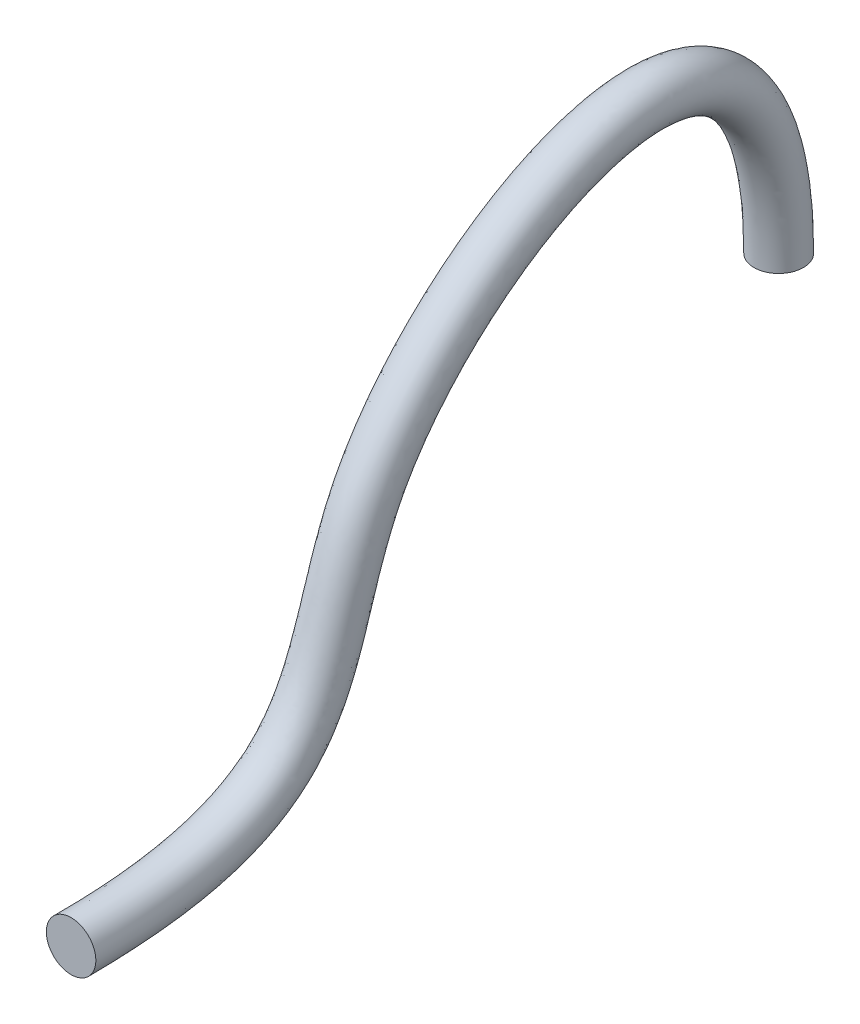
ISO-10303-21;
HEADER;
FILE_DESCRIPTION(('STEP AP214'),'2;1');
FILE_NAME('part.step','',(''),(''),'','','');
FILE_SCHEMA(('AUTOMOTIVE_DESIGN { 1 0 10303 214 1 1 1 1 }'));
ENDSEC;
DATA;
#1=APPLICATION_CONTEXT('core data for automotive mechanical design processes');
#2=APPLICATION_PROTOCOL_DEFINITION('international standard','automotive_design',2000,#1);
#3=PRODUCT_CONTEXT('',#1,'mechanical');
#4=PRODUCT('Part','Part','',(#3));
#5=PRODUCT_RELATED_PRODUCT_CATEGORY('part','',(#4));
#6=PRODUCT_DEFINITION_FORMATION('','',#4);
#7=PRODUCT_DEFINITION_CONTEXT('part definition',#1,'design');
#8=PRODUCT_DEFINITION('design','',#6,#7);
#9=PRODUCT_DEFINITION_SHAPE('','',#8);
#10=(LENGTH_UNIT() NAMED_UNIT(*) SI_UNIT(.MILLI.,.METRE.));
#11=(NAMED_UNIT(*) PLANE_ANGLE_UNIT() SI_UNIT($,.RADIAN.));
#12=(NAMED_UNIT(*) SI_UNIT($,.STERADIAN.) SOLID_ANGLE_UNIT());
#13=UNCERTAINTY_MEASURE_WITH_UNIT(LENGTH_MEASURE(1.E-05),#10,'distance_accuracy_value','');
#14=(GEOMETRIC_REPRESENTATION_CONTEXT(3) GLOBAL_UNCERTAINTY_ASSIGNED_CONTEXT((#13)) GLOBAL_UNIT_ASSIGNED_CONTEXT((#10,
#11,#12)) REPRESENTATION_CONTEXT('',''));
#15=CARTESIAN_POINT('',(0.,0.,0.));
#16=DIRECTION('',(0.,0.,1.));
#17=DIRECTION('',(1.,0.,0.));
#18=AXIS2_PLACEMENT_3D('',#15,#16,#17);
#19=CARTESIAN_POINT('',(0.,845.,620.));
#20=DIRECTION('',(0.,0.,-1.));
#21=DIRECTION('',(-1.,0.,0.));
#22=AXIS2_PLACEMENT_3D('',#19,#20,#21);
#23=PLANE('',#22);
#24=CARTESIAN_POINT('',(0.,845.,620.));
#25=DIRECTION('',(0.,0.,-1.));
#26=DIRECTION('',(-1.,0.,0.));
#27=AXIS2_PLACEMENT_3D('',#24,#25,#26);
#28=CIRCLE('',#27,5.);
#29=CARTESIAN_POINT('',(-5.,845.,620.));
#30=VERTEX_POINT('',#29);
#31=EDGE_CURVE('E43',#30,#30,#28,.T.);
#32=ORIENTED_EDGE('',*,*,#31,.F.);
#33=EDGE_LOOP('',(#32));
#34=FACE_BOUND('',#33,.T.);
#35=ADVANCED_FACE('F36',(#34),#23,.F.);
#36=CARTESIAN_POINT('',(0.,894.749371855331,477.));
#37=DIRECTION('',(0.,-1.,0.));
#38=DIRECTION('',(-1.,0.,0.));
#39=AXIS2_PLACEMENT_3D('',#36,#37,#38);
#40=PLANE('',#39);
#41=CARTESIAN_POINT('',(0.,894.749371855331,477.));
#42=DIRECTION('',(0.,-1.,0.));
#43=DIRECTION('',(-1.,0.,0.));
#44=AXIS2_PLACEMENT_3D('',#41,#42,#43);
#45=CIRCLE('',#44,5.);
#46=CARTESIAN_POINT('',(-5.,894.749371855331,477.));
#47=VERTEX_POINT('',#46);
#48=EDGE_CURVE('E11',#47,#47,#45,.T.);
#49=ORIENTED_EDGE('',*,*,#48,.T.);
#50=EDGE_LOOP('',(#49));
#51=FACE_BOUND('',#50,.T.);
#52=ADVANCED_FACE('F50',(#51),#40,.T.);
#53=CARTESIAN_POINT('',(-5.,845.,620.));
#54=CARTESIAN_POINT('',(-5.,845.000000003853,613.058349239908));
#55=CARTESIAN_POINT('',(-5.,845.405369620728,607.105494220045));
#56=CARTESIAN_POINT('',(-5.,846.918133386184,596.852183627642));
#57=CARTESIAN_POINT('',(-5.,848.025527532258,592.551728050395));
#58=CARTESIAN_POINT('',(-5.,850.833625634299,585.278024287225));
#59=CARTESIAN_POINT('',(-5.,852.534329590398,582.304776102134));
#60=CARTESIAN_POINT('',(-5.,856.420332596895,577.360295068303));
#61=CARTESIAN_POINT('',(-5.,858.605631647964,575.389062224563));
#62=CARTESIAN_POINT('',(-5.,863.352110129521,572.12341982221));
#63=CARTESIAN_POINT('',(-5.,865.913289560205,570.829010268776));
#64=CARTESIAN_POINT('',(-5.,871.302814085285,568.591822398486));
#65=CARTESIAN_POINT('',(-5.,874.131159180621,567.64904408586));
#66=CARTESIAN_POINT('',(-5.,879.946300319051,565.789926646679));
#67=CARTESIAN_POINT('',(-5.,882.933096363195,564.873587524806));
#68=CARTESIAN_POINT('',(-5.,888.956424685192,562.742156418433));
#69=CARTESIAN_POINT('',(-5.,891.992956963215,561.527064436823));
#70=CARTESIAN_POINT('',(-5.,899.561224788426,557.68367659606));
#71=CARTESIAN_POINT('',(-5.,904.054599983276,554.649559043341));
#72=CARTESIAN_POINT('',(-5.,912.527944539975,547.577017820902));
#73=CARTESIAN_POINT('',(-5.,916.507913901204,543.538594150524));
#74=CARTESIAN_POINT('',(-5.,923.576740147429,534.888722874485));
#75=CARTESIAN_POINT('',(-5.,926.665597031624,530.277275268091));
#76=CARTESIAN_POINT('',(-5.,931.574491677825,520.912638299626));
#77=CARTESIAN_POINT('',(-5.,933.394529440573,516.159448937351));
#78=CARTESIAN_POINT('',(-5.,934.889691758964,509.246820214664));
#79=CARTESIAN_POINT('',(-5.,935.18226347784,506.978803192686));
#80=CARTESIAN_POINT('',(-5.,935.308562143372,502.569064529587));
#81=CARTESIAN_POINT('',(-5.,935.142289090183,500.427342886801));
#82=CARTESIAN_POINT('',(-5.,934.303684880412,496.324105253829));
#83=CARTESIAN_POINT('',(-5.,933.631353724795,494.36258926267));
#84=CARTESIAN_POINT('',(-5.,931.73341997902,490.673673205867));
#85=CARTESIAN_POINT('',(-5.,930.507817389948,488.946273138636));
#86=CARTESIAN_POINT('',(-5.,927.456127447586,485.779499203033));
#87=CARTESIAN_POINT('',(-5.,925.630040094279,484.340125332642));
#88=CARTESIAN_POINT('',(-5.,921.330167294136,481.803314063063));
#89=CARTESIAN_POINT('',(-5.,918.856381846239,480.705876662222));
#90=CARTESIAN_POINT('',(-5.,910.392658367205,478.007334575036));
#91=CARTESIAN_POINT('',(-5.,903.360353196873,476.999999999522));
#92=CARTESIAN_POINT('',(-5.,894.749371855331,477.));
#93=CARTESIAN_POINT('',(-5.,855.,620.));
#94=CARTESIAN_POINT('',(-5.,855.000000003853,613.447660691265));
#95=CARTESIAN_POINT('',(-5.,855.386123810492,607.969663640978));
#96=CARTESIAN_POINT('',(-5.,856.72319197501,598.907194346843));
#97=CARTESIAN_POINT('',(-5.,857.672099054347,595.330490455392));
#98=CARTESIAN_POINT('',(-5.,859.844910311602,589.702344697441));
#99=CARTESIAN_POINT('',(-5.,861.051869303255,587.650400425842));
#100=CARTESIAN_POINT('',(-5.,863.627531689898,584.37317346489));
#101=CARTESIAN_POINT('',(-5.,865.008452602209,583.122049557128));
#102=CARTESIAN_POINT('',(-5.,868.285612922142,580.867318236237));
#103=CARTESIAN_POINT('',(-5.,870.197857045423,579.877803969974));
#104=CARTESIAN_POINT('',(-5.,874.685878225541,578.01482950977));
#105=CARTESIAN_POINT('',(-5.,877.252730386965,577.149687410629));
#106=CARTESIAN_POINT('',(-5.,882.91510922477,575.339408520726));
#107=CARTESIAN_POINT('',(-5.,886.00831021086,574.393017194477));
#108=CARTESIAN_POINT('',(-5.,892.553060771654,572.077074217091));
#109=CARTESIAN_POINT('',(-5.,896.007072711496,570.704151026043));
#110=CARTESIAN_POINT('',(-5.,904.868442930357,566.204087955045));
#111=CARTESIAN_POINT('',(-5.,909.952460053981,562.752441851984));
#112=CARTESIAN_POINT('',(-5.,919.445981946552,554.828377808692));
#113=CARTESIAN_POINT('',(-5.,923.8536333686,550.352919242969));
#114=CARTESIAN_POINT('',(-5.,931.717483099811,540.730206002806));
#115=CARTESIAN_POINT('',(-5.,935.174274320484,535.584346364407));
#116=CARTESIAN_POINT('',(-5.,940.779638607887,524.891062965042));
#117=CARTESIAN_POINT('',(-5.,942.937139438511,519.343224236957));
#118=CARTESIAN_POINT('',(-5.,944.779362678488,510.826018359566));
#119=CARTESIAN_POINT('',(-5.,945.158477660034,507.95246383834));
#120=CARTESIAN_POINT('',(-5.,945.324150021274,502.167986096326));
#121=CARTESIAN_POINT('',(-5.,945.109301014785,499.254506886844));
#122=CARTESIAN_POINT('',(-5.,943.931622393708,493.492199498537));
#123=CARTESIAN_POINT('',(-5.,942.96391237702,490.643693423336));
#124=CARTESIAN_POINT('',(-5.,940.185093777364,485.242646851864));
#125=CARTESIAN_POINT('',(-5.,938.373566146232,482.69738761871));
#126=CARTESIAN_POINT('',(-5.,933.991774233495,478.150351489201));
#127=CARTESIAN_POINT('',(-5.,931.42859291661,476.150481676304));
#128=CARTESIAN_POINT('',(-5.,925.694253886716,472.767373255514));
#129=CARTESIAN_POINT('',(-5.,922.52495401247,471.379567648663));
#130=CARTESIAN_POINT('',(-5.,912.16860845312,468.077588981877));
#131=CARTESIAN_POINT('',(-5.,904.140236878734,467.));
#132=CARTESIAN_POINT('',(-5.,894.749371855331,467.));
#133=CARTESIAN_POINT('',(5.,855.,620.));
#134=CARTESIAN_POINT('',(5.,855.000000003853,613.447660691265));
#135=CARTESIAN_POINT('',(5.,855.386123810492,607.969663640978));
#136=CARTESIAN_POINT('',(5.,856.72319197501,598.907194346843));
#137=CARTESIAN_POINT('',(5.,857.672099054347,595.330490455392));
#138=CARTESIAN_POINT('',(5.,859.844910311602,589.702344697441));
#139=CARTESIAN_POINT('',(5.,861.051869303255,587.650400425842));
#140=CARTESIAN_POINT('',(5.,863.627531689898,584.37317346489));
#141=CARTESIAN_POINT('',(5.,865.008452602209,583.122049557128));
#142=CARTESIAN_POINT('',(5.,868.285612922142,580.867318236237));
#143=CARTESIAN_POINT('',(5.,870.197857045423,579.877803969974));
#144=CARTESIAN_POINT('',(5.,874.685878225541,578.01482950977));
#145=CARTESIAN_POINT('',(5.,877.252730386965,577.149687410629));
#146=CARTESIAN_POINT('',(5.,882.91510922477,575.339408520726));
#147=CARTESIAN_POINT('',(5.,886.00831021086,574.393017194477));
#148=CARTESIAN_POINT('',(5.,892.553060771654,572.077074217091));
#149=CARTESIAN_POINT('',(5.,896.007072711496,570.704151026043));
#150=CARTESIAN_POINT('',(5.,904.868442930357,566.204087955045));
#151=CARTESIAN_POINT('',(5.,909.952460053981,562.752441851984));
#152=CARTESIAN_POINT('',(5.,919.445981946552,554.828377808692));
#153=CARTESIAN_POINT('',(5.,923.8536333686,550.352919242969));
#154=CARTESIAN_POINT('',(5.,931.717483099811,540.730206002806));
#155=CARTESIAN_POINT('',(5.,935.174274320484,535.584346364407));
#156=CARTESIAN_POINT('',(5.,940.779638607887,524.891062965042));
#157=CARTESIAN_POINT('',(5.,942.937139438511,519.343224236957));
#158=CARTESIAN_POINT('',(5.,944.779362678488,510.826018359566));
#159=CARTESIAN_POINT('',(5.,945.158477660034,507.95246383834));
#160=CARTESIAN_POINT('',(5.,945.324150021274,502.167986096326));
#161=CARTESIAN_POINT('',(5.,945.109301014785,499.254506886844));
#162=CARTESIAN_POINT('',(5.,943.931622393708,493.492199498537));
#163=CARTESIAN_POINT('',(5.,942.96391237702,490.643693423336));
#164=CARTESIAN_POINT('',(5.,940.185093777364,485.242646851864));
#165=CARTESIAN_POINT('',(5.,938.373566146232,482.69738761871));
#166=CARTESIAN_POINT('',(5.,933.991774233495,478.150351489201));
#167=CARTESIAN_POINT('',(5.,931.42859291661,476.150481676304));
#168=CARTESIAN_POINT('',(5.,925.694253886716,472.767373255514));
#169=CARTESIAN_POINT('',(5.,922.52495401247,471.379567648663));
#170=CARTESIAN_POINT('',(5.,912.16860845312,468.077588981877));
#171=CARTESIAN_POINT('',(5.,904.140236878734,467.));
#172=CARTESIAN_POINT('',(5.,894.749371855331,467.));
#173=CARTESIAN_POINT('',(5.,845.,620.));
#174=CARTESIAN_POINT('',(5.,845.000000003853,613.058349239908));
#175=CARTESIAN_POINT('',(5.,845.405369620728,607.105494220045));
#176=CARTESIAN_POINT('',(5.,846.918133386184,596.852183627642));
#177=CARTESIAN_POINT('',(5.,848.025527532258,592.551728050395));
#178=CARTESIAN_POINT('',(5.,850.833625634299,585.278024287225));
#179=CARTESIAN_POINT('',(5.,852.534329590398,582.304776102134));
#180=CARTESIAN_POINT('',(5.,856.420332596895,577.360295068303));
#181=CARTESIAN_POINT('',(5.,858.605631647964,575.389062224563));
#182=CARTESIAN_POINT('',(5.,863.352110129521,572.12341982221));
#183=CARTESIAN_POINT('',(5.,865.913289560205,570.829010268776));
#184=CARTESIAN_POINT('',(5.,871.302814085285,568.591822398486));
#185=CARTESIAN_POINT('',(5.,874.131159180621,567.64904408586));
#186=CARTESIAN_POINT('',(5.,879.946300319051,565.789926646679));
#187=CARTESIAN_POINT('',(5.,882.933096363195,564.873587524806));
#188=CARTESIAN_POINT('',(5.,888.956424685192,562.742156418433));
#189=CARTESIAN_POINT('',(5.,891.992956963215,561.527064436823));
#190=CARTESIAN_POINT('',(5.,899.561224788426,557.68367659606));
#191=CARTESIAN_POINT('',(5.,904.054599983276,554.649559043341));
#192=CARTESIAN_POINT('',(5.,912.527944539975,547.577017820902));
#193=CARTESIAN_POINT('',(5.,916.507913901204,543.538594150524));
#194=CARTESIAN_POINT('',(5.,923.576740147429,534.888722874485));
#195=CARTESIAN_POINT('',(5.,926.665597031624,530.277275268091));
#196=CARTESIAN_POINT('',(5.,931.574491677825,520.912638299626));
#197=CARTESIAN_POINT('',(5.,933.394529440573,516.159448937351));
#198=CARTESIAN_POINT('',(5.,934.889691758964,509.246820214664));
#199=CARTESIAN_POINT('',(5.,935.18226347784,506.978803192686));
#200=CARTESIAN_POINT('',(5.,935.308562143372,502.569064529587));
#201=CARTESIAN_POINT('',(5.,935.142289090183,500.427342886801));
#202=CARTESIAN_POINT('',(5.,934.303684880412,496.324105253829));
#203=CARTESIAN_POINT('',(5.,933.631353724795,494.36258926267));
#204=CARTESIAN_POINT('',(5.,931.73341997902,490.673673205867));
#205=CARTESIAN_POINT('',(5.,930.507817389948,488.946273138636));
#206=CARTESIAN_POINT('',(5.,927.456127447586,485.779499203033));
#207=CARTESIAN_POINT('',(5.,925.630040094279,484.340125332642));
#208=CARTESIAN_POINT('',(5.,921.330167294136,481.803314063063));
#209=CARTESIAN_POINT('',(5.,918.856381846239,480.705876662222));
#210=CARTESIAN_POINT('',(5.,910.392658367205,478.007334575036));
#211=CARTESIAN_POINT('',(5.,903.360353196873,476.999999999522));
#212=CARTESIAN_POINT('',(5.,894.749371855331,477.));
#213=CARTESIAN_POINT('',(5.,835.,620.));
#214=CARTESIAN_POINT('',(5.,835.000000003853,612.669037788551));
#215=CARTESIAN_POINT('',(5.,835.424615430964,606.241324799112));
#216=CARTESIAN_POINT('',(5.,837.113074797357,594.79717290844));
#217=CARTESIAN_POINT('',(5.,838.378956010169,589.772965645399));
#218=CARTESIAN_POINT('',(5.,841.822340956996,580.853703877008));
#219=CARTESIAN_POINT('',(5.,844.016789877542,576.959151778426));
#220=CARTESIAN_POINT('',(5.,849.213133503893,570.347416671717));
#221=CARTESIAN_POINT('',(5.,852.202810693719,567.656074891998));
#222=CARTESIAN_POINT('',(5.,858.4186073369,563.379521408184));
#223=CARTESIAN_POINT('',(5.,861.628722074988,561.780216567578));
#224=CARTESIAN_POINT('',(5.,867.919749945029,559.168815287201));
#225=CARTESIAN_POINT('',(5.,871.009587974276,558.14840076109));
#226=CARTESIAN_POINT('',(5.,876.977491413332,556.240444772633));
#227=CARTESIAN_POINT('',(5.,879.857882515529,555.354157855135));
#228=CARTESIAN_POINT('',(5.,885.35978859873,553.407238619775));
#229=CARTESIAN_POINT('',(5.,887.978841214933,552.349977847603));
#230=CARTESIAN_POINT('',(5.,894.254006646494,549.163265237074));
#231=CARTESIAN_POINT('',(5.,898.156739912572,546.546676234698));
#232=CARTESIAN_POINT('',(5.,905.609907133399,540.325657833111));
#233=CARTESIAN_POINT('',(5.,909.162194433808,536.724269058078));
#234=CARTESIAN_POINT('',(5.,915.435997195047,529.047239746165));
#235=CARTESIAN_POINT('',(5.,918.156919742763,524.970204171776));
#236=CARTESIAN_POINT('',(5.,922.369344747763,516.934213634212));
#237=CARTESIAN_POINT('',(5.,923.851919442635,512.975673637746));
#238=CARTESIAN_POINT('',(5.,925.00002083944,507.667622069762));
#239=CARTESIAN_POINT('',(5.,925.206049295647,506.005142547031));
#240=CARTESIAN_POINT('',(5.,925.292974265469,502.970142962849));
#241=CARTESIAN_POINT('',(5.,925.175277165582,501.600178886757));
#242=CARTESIAN_POINT('',(5.,924.675747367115,499.156011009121));
#243=CARTESIAN_POINT('',(5.,924.29879507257,498.081485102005));
#244=CARTESIAN_POINT('',(5.,923.281746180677,496.10469955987));
#245=CARTESIAN_POINT('',(5.,922.642068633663,495.195158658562));
#246=CARTESIAN_POINT('',(5.,920.920480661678,493.408646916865));
#247=CARTESIAN_POINT('',(5.,919.831487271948,492.52976898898));
#248=CARTESIAN_POINT('',(5.,916.966080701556,490.839254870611));
#249=CARTESIAN_POINT('',(5.,915.187809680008,490.032185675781));
#250=CARTESIAN_POINT('',(5.,908.616708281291,487.937080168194));
#251=CARTESIAN_POINT('',(5.,902.580469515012,486.999999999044));
#252=CARTESIAN_POINT('',(5.,894.749371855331,487.));
#253=CARTESIAN_POINT('',(-5.,835.,620.));
#254=CARTESIAN_POINT('',(-5.,835.000000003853,612.669037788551));
#255=CARTESIAN_POINT('',(-5.,835.424615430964,606.241324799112));
#256=CARTESIAN_POINT('',(-5.,837.113074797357,594.79717290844));
#257=CARTESIAN_POINT('',(-5.,838.378956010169,589.772965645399));
#258=CARTESIAN_POINT('',(-5.,841.822340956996,580.853703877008));
#259=CARTESIAN_POINT('',(-5.,844.016789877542,576.959151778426));
#260=CARTESIAN_POINT('',(-5.,849.213133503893,570.347416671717));
#261=CARTESIAN_POINT('',(-5.,852.202810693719,567.656074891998));
#262=CARTESIAN_POINT('',(-5.,858.4186073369,563.379521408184));
#263=CARTESIAN_POINT('',(-5.,861.628722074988,561.780216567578));
#264=CARTESIAN_POINT('',(-5.,867.919749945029,559.168815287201));
#265=CARTESIAN_POINT('',(-5.,871.009587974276,558.14840076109));
#266=CARTESIAN_POINT('',(-5.,876.977491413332,556.240444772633));
#267=CARTESIAN_POINT('',(-5.,879.857882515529,555.354157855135));
#268=CARTESIAN_POINT('',(-5.,885.35978859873,553.407238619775));
#269=CARTESIAN_POINT('',(-5.,887.978841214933,552.349977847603));
#270=CARTESIAN_POINT('',(-5.,894.254006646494,549.163265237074));
#271=CARTESIAN_POINT('',(-5.,898.156739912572,546.546676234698));
#272=CARTESIAN_POINT('',(-5.,905.609907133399,540.325657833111));
#273=CARTESIAN_POINT('',(-5.,909.162194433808,536.724269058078));
#274=CARTESIAN_POINT('',(-5.,915.435997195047,529.047239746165));
#275=CARTESIAN_POINT('',(-5.,918.156919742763,524.970204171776));
#276=CARTESIAN_POINT('',(-5.,922.369344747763,516.934213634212));
#277=CARTESIAN_POINT('',(-5.,923.851919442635,512.975673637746));
#278=CARTESIAN_POINT('',(-5.,925.00002083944,507.667622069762));
#279=CARTESIAN_POINT('',(-5.,925.206049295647,506.005142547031));
#280=CARTESIAN_POINT('',(-5.,925.292974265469,502.970142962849));
#281=CARTESIAN_POINT('',(-5.,925.175277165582,501.600178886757));
#282=CARTESIAN_POINT('',(-5.,924.675747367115,499.156011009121));
#283=CARTESIAN_POINT('',(-5.,924.29879507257,498.081485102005));
#284=CARTESIAN_POINT('',(-5.,923.281746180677,496.10469955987));
#285=CARTESIAN_POINT('',(-5.,922.642068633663,495.195158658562));
#286=CARTESIAN_POINT('',(-5.,920.920480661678,493.408646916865));
#287=CARTESIAN_POINT('',(-5.,919.831487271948,492.52976898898));
#288=CARTESIAN_POINT('',(-5.,916.966080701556,490.839254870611));
#289=CARTESIAN_POINT('',(-5.,915.187809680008,490.032185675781));
#290=CARTESIAN_POINT('',(-5.,908.616708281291,487.937080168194));
#291=CARTESIAN_POINT('',(-5.,902.580469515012,486.999999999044));
#292=CARTESIAN_POINT('',(-5.,894.749371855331,487.));
#293=CARTESIAN_POINT('',(-5.,845.,620.));
#294=CARTESIAN_POINT('',(-5.,845.000000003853,613.058349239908));
#295=CARTESIAN_POINT('',(-5.,845.405369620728,607.105494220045));
#296=CARTESIAN_POINT('',(-5.,846.918133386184,596.852183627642));
#297=CARTESIAN_POINT('',(-5.,848.025527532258,592.551728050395));
#298=CARTESIAN_POINT('',(-5.,850.833625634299,585.278024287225));
#299=CARTESIAN_POINT('',(-5.,852.534329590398,582.304776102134));
#300=CARTESIAN_POINT('',(-5.,856.420332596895,577.360295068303));
#301=CARTESIAN_POINT('',(-5.,858.605631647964,575.389062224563));
#302=CARTESIAN_POINT('',(-5.,863.352110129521,572.12341982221));
#303=CARTESIAN_POINT('',(-5.,865.913289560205,570.829010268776));
#304=CARTESIAN_POINT('',(-5.,871.302814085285,568.591822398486));
#305=CARTESIAN_POINT('',(-5.,874.131159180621,567.64904408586));
#306=CARTESIAN_POINT('',(-5.,879.946300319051,565.789926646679));
#307=CARTESIAN_POINT('',(-5.,882.933096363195,564.873587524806));
#308=CARTESIAN_POINT('',(-5.,888.956424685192,562.742156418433));
#309=CARTESIAN_POINT('',(-5.,891.992956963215,561.527064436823));
#310=CARTESIAN_POINT('',(-5.,899.561224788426,557.68367659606));
#311=CARTESIAN_POINT('',(-5.,904.054599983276,554.649559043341));
#312=CARTESIAN_POINT('',(-5.,912.527944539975,547.577017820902));
#313=CARTESIAN_POINT('',(-5.,916.507913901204,543.538594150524));
#314=CARTESIAN_POINT('',(-5.,923.576740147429,534.888722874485));
#315=CARTESIAN_POINT('',(-5.,926.665597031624,530.277275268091));
#316=CARTESIAN_POINT('',(-5.,931.574491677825,520.912638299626));
#317=CARTESIAN_POINT('',(-5.,933.394529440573,516.159448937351));
#318=CARTESIAN_POINT('',(-5.,934.889691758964,509.246820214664));
#319=CARTESIAN_POINT('',(-5.,935.18226347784,506.978803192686));
#320=CARTESIAN_POINT('',(-5.,935.308562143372,502.569064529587));
#321=CARTESIAN_POINT('',(-5.,935.142289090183,500.427342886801));
#322=CARTESIAN_POINT('',(-5.,934.303684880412,496.324105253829));
#323=CARTESIAN_POINT('',(-5.,933.631353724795,494.36258926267));
#324=CARTESIAN_POINT('',(-5.,931.73341997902,490.673673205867));
#325=CARTESIAN_POINT('',(-5.,930.507817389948,488.946273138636));
#326=CARTESIAN_POINT('',(-5.,927.456127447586,485.779499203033));
#327=CARTESIAN_POINT('',(-5.,925.630040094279,484.340125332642));
#328=CARTESIAN_POINT('',(-5.,921.330167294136,481.803314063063));
#329=CARTESIAN_POINT('',(-5.,918.856381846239,480.705876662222));
#330=CARTESIAN_POINT('',(-5.,910.392658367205,478.007334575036));
#331=CARTESIAN_POINT('',(-5.,903.360353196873,476.999999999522));
#332=CARTESIAN_POINT('',(-5.,894.749371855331,477.));
#333=(BOUNDED_SURFACE() B_SPLINE_SURFACE(3,3,((#53,#54,#55,#56,#57,#58,#59,#60,#61,#62,#63,#64,
#65,#66,#67,#68,#69,#70,#71,#72,#73,#74,#75,#76,#77,#78,#79,#80,#81,#82,#83,#84,#85,#86,#87,#88,
#89,#90,#91,#92),(#93,#94,#95,#96,#97,#98,#99,#100,#101,#102,#103,#104,#105,#106,#107,#108,#109,
#110,#111,#112,#113,#114,#115,#116,#117,#118,#119,#120,#121,#122,#123,#124,#125,#126,#127,#128,
#129,#130,#131,#132),(#133,#134,#135,#136,#137,#138,#139,#140,#141,#142,#143,#144,#145,#146,
#147,#148,#149,#150,#151,#152,#153,#154,#155,#156,#157,#158,#159,#160,#161,#162,#163,#164,#165,
#166,#167,#168,#169,#170,#171,#172),(#173,#174,#175,#176,#177,#178,#179,#180,#181,#182,#183,
#184,#185,#186,#187,#188,#189,#190,#191,#192,#193,#194,#195,#196,#197,#198,#199,#200,#201,#202,
#203,#204,#205,#206,#207,#208,#209,#210,#211,#212),(#213,#214,#215,#216,#217,#218,#219,#220,
#221,#222,#223,#224,#225,#226,#227,#228,#229,#230,#231,#232,#233,#234,#235,#236,#237,#238,#239,
#240,#241,#242,#243,#244,#245,#246,#247,#248,#249,#250,#251,#252),(#253,#254,#255,#256,#257,
#258,#259,#260,#261,#262,#263,#264,#265,#266,#267,#268,#269,#270,#271,#272,#273,#274,#275,#276,
#277,#278,#279,#280,#281,#282,#283,#284,#285,#286,#287,#288,#289,#290,#291,#292),(#293,#294,
#295,#296,#297,#298,#299,#300,#301,#302,#303,#304,#305,#306,#307,#308,#309,#310,#311,#312,#313,
#314,#315,#316,#317,#318,#319,#320,#321,#322,#323,#324,#325,#326,#327,#328,#329,#330,#331,
#332)),.UNSPECIFIED.,.T.,.F.,.F.) B_SPLINE_SURFACE_WITH_KNOTS((4,3,4),(4,2,2,2,2,2,2,2,2,2,2,2,
2,2,2,2,2,2,2,4),(0.,0.5,1.),(0.,0.0496653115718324,0.0993306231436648,0.148995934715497,
0.19866124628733,0.248326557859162,0.297991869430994,0.347657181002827,0.397322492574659,
0.472657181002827,0.547991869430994,0.623326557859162,0.69866124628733,0.736328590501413,
0.773995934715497,0.811663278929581,0.849330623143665,0.886997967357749,0.924665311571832,1.),
.UNSPECIFIED.) GEOMETRIC_REPRESENTATION_ITEM() RATIONAL_B_SPLINE_SURFACE(((1.,1.,1.,1.,1.,1.,1.,
1.,1.,1.,1.,1.,1.,1.,1.,1.,1.,1.,1.,1.,1.,1.,1.,1.,1.,1.,1.,1.,1.,1.,1.,1.,1.,1.,1.,1.,1.,1.,1.,
1.),(0.333333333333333,0.333333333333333,0.333333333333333,0.333333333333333,0.333333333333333,
0.333333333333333,0.333333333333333,0.333333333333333,0.333333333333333,0.333333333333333,
0.333333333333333,0.333333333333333,0.333333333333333,0.333333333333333,0.333333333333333,
0.333333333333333,0.333333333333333,0.333333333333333,0.333333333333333,0.333333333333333,
0.333333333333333,0.333333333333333,0.333333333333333,0.333333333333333,0.333333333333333,
0.333333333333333,0.333333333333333,0.333333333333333,0.333333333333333,0.333333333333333,
0.333333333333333,0.333333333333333,0.333333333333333,0.333333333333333,0.333333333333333,
0.333333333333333,0.333333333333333,0.333333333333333,0.333333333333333,0.333333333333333),
(0.333333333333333,0.333333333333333,0.333333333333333,0.333333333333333,0.333333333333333,
0.333333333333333,0.333333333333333,0.333333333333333,0.333333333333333,0.333333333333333,
0.333333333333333,0.333333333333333,0.333333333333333,0.333333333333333,0.333333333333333,
0.333333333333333,0.333333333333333,0.333333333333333,0.333333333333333,0.333333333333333,
0.333333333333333,0.333333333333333,0.333333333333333,0.333333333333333,0.333333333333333,
0.333333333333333,0.333333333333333,0.333333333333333,0.333333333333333,0.333333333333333,
0.333333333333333,0.333333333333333,0.333333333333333,0.333333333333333,0.333333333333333,
0.333333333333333,0.333333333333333,0.333333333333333,0.333333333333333,0.333333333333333),(1.,
1.,1.,1.,1.,1.,1.,1.,1.,1.,1.,1.,1.,1.,1.,1.,1.,1.,1.,1.,1.,1.,1.,1.,1.,1.,1.,1.,1.,1.,1.,1.,1.,
1.,1.,1.,1.,1.,1.,1.),(0.333333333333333,0.333333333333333,0.333333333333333,0.333333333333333,
0.333333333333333,0.333333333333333,0.333333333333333,0.333333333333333,0.333333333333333,
0.333333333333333,0.333333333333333,0.333333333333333,0.333333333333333,0.333333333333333,
0.333333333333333,0.333333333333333,0.333333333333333,0.333333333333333,0.333333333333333,
0.333333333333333,0.333333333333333,0.333333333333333,0.333333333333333,0.333333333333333,
0.333333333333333,0.333333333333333,0.333333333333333,0.333333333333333,0.333333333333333,
0.333333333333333,0.333333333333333,0.333333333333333,0.333333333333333,0.333333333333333,
0.333333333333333,0.333333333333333,0.333333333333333,0.333333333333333,0.333333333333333,
0.333333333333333),(0.333333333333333,0.333333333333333,0.333333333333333,0.333333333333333,
0.333333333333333,0.333333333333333,0.333333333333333,0.333333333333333,0.333333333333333,
0.333333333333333,0.333333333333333,0.333333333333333,0.333333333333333,0.333333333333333,
0.333333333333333,0.333333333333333,0.333333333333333,0.333333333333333,0.333333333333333,
0.333333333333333,0.333333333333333,0.333333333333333,0.333333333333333,0.333333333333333,
0.333333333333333,0.333333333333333,0.333333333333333,0.333333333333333,0.333333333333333,
0.333333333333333,0.333333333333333,0.333333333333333,0.333333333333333,0.333333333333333,
0.333333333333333,0.333333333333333,0.333333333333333,0.333333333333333,0.333333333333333,
0.333333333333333),(1.,1.,1.,1.,1.,1.,1.,1.,1.,1.,1.,1.,1.,1.,1.,1.,1.,1.,1.,1.,1.,1.,1.,1.,1.,
1.,1.,1.,1.,1.,1.,1.,1.,1.,1.,1.,1.,1.,1.,1.))) REPRESENTATION_ITEM('') SURFACE());
#334=ORIENTED_EDGE('',*,*,#48,.F.);
#335=EDGE_LOOP('',(#334));
#336=FACE_BOUND('',#335,.T.);
#337=ORIENTED_EDGE('',*,*,#31,.T.);
#338=EDGE_LOOP('',(#337));
#339=FACE_BOUND('',#338,.T.);
#340=ADVANCED_FACE('F52',(#336,#339),#333,.T.);
#341=CLOSED_SHELL('',(#35,#52,#340));
#342=MANIFOLD_SOLID_BREP('B2',#341);
#343=ADVANCED_BREP_SHAPE_REPRESENTATION('',(#18,#342),#14);
#344=SHAPE_DEFINITION_REPRESENTATION(#9,#343);
ENDSEC;
END-ISO-10303-21;
